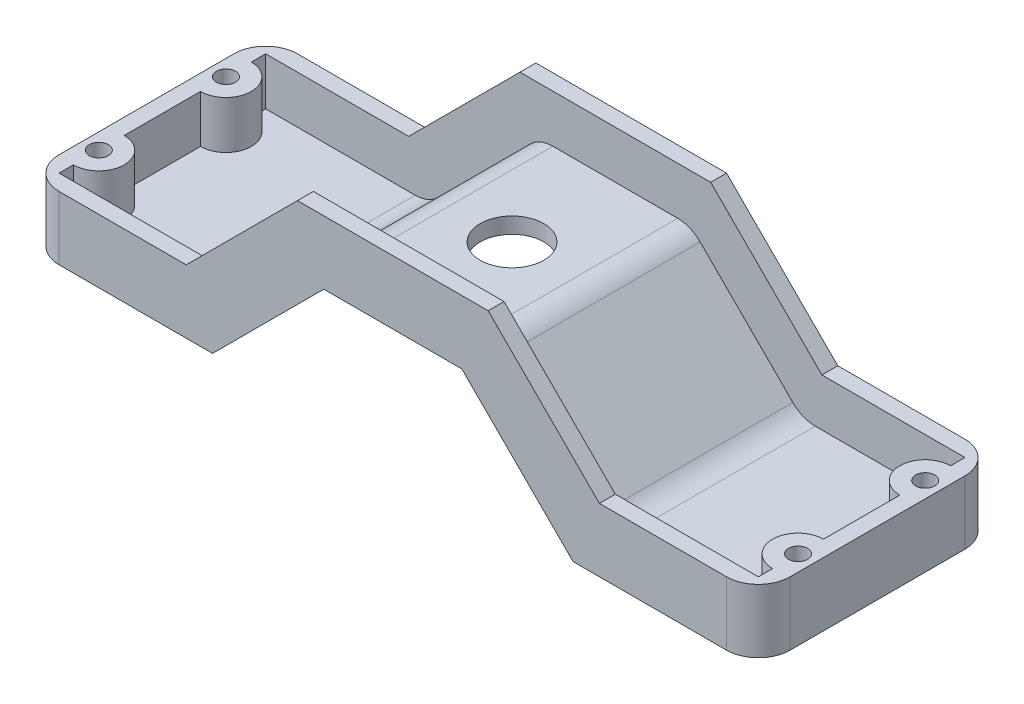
ISO-10303-21;
HEADER;
FILE_DESCRIPTION(('STEP AP214'),'2;1');
FILE_NAME('part.step','',(''),(''),'','','');
FILE_SCHEMA(('AUTOMOTIVE_DESIGN { 1 0 10303 214 1 1 1 1 }'));
ENDSEC;
DATA;
#1=APPLICATION_CONTEXT('core data for automotive mechanical design processes');
#2=APPLICATION_PROTOCOL_DEFINITION('international standard','automotive_design',2000,#1);
#3=PRODUCT_CONTEXT('',#1,'mechanical');
#4=PRODUCT('Part','Part','',(#3));
#5=PRODUCT_RELATED_PRODUCT_CATEGORY('part','',(#4));
#6=PRODUCT_DEFINITION_FORMATION('','',#4);
#7=PRODUCT_DEFINITION_CONTEXT('part definition',#1,'design');
#8=PRODUCT_DEFINITION('design','',#6,#7);
#9=PRODUCT_DEFINITION_SHAPE('','',#8);
#10=(LENGTH_UNIT() NAMED_UNIT(*) SI_UNIT(.MILLI.,.METRE.));
#11=(NAMED_UNIT(*) PLANE_ANGLE_UNIT() SI_UNIT($,.RADIAN.));
#12=(NAMED_UNIT(*) SI_UNIT($,.STERADIAN.) SOLID_ANGLE_UNIT());
#13=UNCERTAINTY_MEASURE_WITH_UNIT(LENGTH_MEASURE(1.E-05),#10,'distance_accuracy_value','');
#14=(GEOMETRIC_REPRESENTATION_CONTEXT(3) GLOBAL_UNCERTAINTY_ASSIGNED_CONTEXT((#13)) GLOBAL_UNIT_ASSIGNED_CONTEXT((#10,
#11,#12)) REPRESENTATION_CONTEXT('',''));
#15=CARTESIAN_POINT('',(0.,0.,0.));
#16=DIRECTION('',(0.,0.,1.));
#17=DIRECTION('',(1.,0.,0.));
#18=AXIS2_PLACEMENT_3D('',#15,#16,#17);
#19=CARTESIAN_POINT('',(180.,0.,37.5));
#20=DIRECTION('',(0.,1.,0.));
#21=DIRECTION('',(-1.,0.,0.));
#22=AXIS2_PLACEMENT_3D('',#19,#20,#21);
#23=PLANE('',#22);
#24=DIRECTION('',(0.,0.,-1.));
#25=VECTOR('',#24,1.);
#26=CARTESIAN_POINT('',(230.,0.,37.5));
#27=LINE('',#26,#25);
#28=CARTESIAN_POINT('',(230.,0.,27.5));
#29=VERTEX_POINT('',#28);
#30=CARTESIAN_POINT('',(230.,0.,-27.5));
#31=VERTEX_POINT('',#30);
#32=EDGE_CURVE('E398',#29,#31,#27,.T.);
#33=ORIENTED_EDGE('',*,*,#32,.T.);
#34=CARTESIAN_POINT('',(220.,0.,-27.5));
#35=DIRECTION('',(0.,1.,0.));
#36=DIRECTION('',(-1.,0.,0.));
#37=AXIS2_PLACEMENT_3D('',#34,#35,#36);
#38=CIRCLE('',#37,10.);
#39=CARTESIAN_POINT('',(220.,0.,-37.5));
#40=VERTEX_POINT('',#39);
#41=EDGE_CURVE('E420',#31,#40,#38,.T.);
#42=ORIENTED_EDGE('',*,*,#41,.T.);
#43=DIRECTION('',(1.,0.,0.));
#44=VECTOR('',#43,1.);
#45=CARTESIAN_POINT('',(180.,0.,-37.5));
#46=LINE('',#45,#44);
#47=CARTESIAN_POINT('',(180.,0.,-37.5));
#48=VERTEX_POINT('',#47);
#49=EDGE_CURVE('E334',#48,#40,#46,.T.);
#50=ORIENTED_EDGE('',*,*,#49,.F.);
#51=DIRECTION('',(0.,0.,-1.));
#52=VECTOR('',#51,1.);
#53=CARTESIAN_POINT('',(180.,0.,37.5));
#54=LINE('',#53,#52);
#55=CARTESIAN_POINT('',(180.,0.,-32.5));
#56=VERTEX_POINT('',#55);
#57=EDGE_CURVE('E394',#56,#48,#54,.T.);
#58=ORIENTED_EDGE('',*,*,#57,.F.);
#59=DIRECTION('',(1.,0.,0.));
#60=VECTOR('',#59,1.);
#61=CARTESIAN_POINT('',(0.,0.,-32.5));
#62=LINE('',#61,#60);
#63=CARTESIAN_POINT('',(225.,0.,-32.5));
#64=VERTEX_POINT('',#63);
#65=EDGE_CURVE('E310',#56,#64,#62,.T.);
#66=ORIENTED_EDGE('',*,*,#65,.T.);
#67=DIRECTION('',(0.,0.,-1.));
#68=VECTOR('',#67,1.);
#69=CARTESIAN_POINT('',(225.,0.,37.5));
#70=LINE('',#69,#68);
#71=CARTESIAN_POINT('',(225.,0.,-28.));
#72=VERTEX_POINT('',#71);
#73=EDGE_CURVE('E302',#72,#64,#70,.T.);
#74=ORIENTED_EDGE('',*,*,#73,.F.);
#75=CARTESIAN_POINT('',(225.,0.,-20.));
#76=DIRECTION('',(0.,-1.,0.));
#77=DIRECTION('',(0.,0.,-1.));
#78=AXIS2_PLACEMENT_3D('',#75,#76,#77);
#79=CIRCLE('',#78,8.);
#80=CARTESIAN_POINT('',(225.,0.,-12.));
#81=VERTEX_POINT('',#80);
#82=EDGE_CURVE('E289',#81,#72,#79,.T.);
#83=ORIENTED_EDGE('',*,*,#82,.F.);
#84=CARTESIAN_POINT('',(225.,0.,12.));
#85=VERTEX_POINT('',#84);
#86=EDGE_CURVE('E311',#85,#81,#70,.T.);
#87=ORIENTED_EDGE('',*,*,#86,.F.);
#88=CARTESIAN_POINT('',(225.,0.,20.));
#89=DIRECTION('',(0.,1.,0.));
#90=DIRECTION('',(0.,0.,1.));
#91=AXIS2_PLACEMENT_3D('',#88,#89,#90);
#92=CIRCLE('',#91,8.);
#93=CARTESIAN_POINT('',(225.,0.,28.));
#94=VERTEX_POINT('',#93);
#95=EDGE_CURVE('E742',#85,#94,#92,.T.);
#96=ORIENTED_EDGE('',*,*,#95,.T.);
#97=CARTESIAN_POINT('',(225.,0.,32.5));
#98=VERTEX_POINT('',#97);
#99=EDGE_CURVE('E58',#98,#94,#70,.T.);
#100=ORIENTED_EDGE('',*,*,#99,.F.);
#101=DIRECTION('',(1.,0.,0.));
#102=VECTOR('',#101,1.);
#103=CARTESIAN_POINT('',(0.,0.,32.5));
#104=LINE('',#103,#102);
#105=CARTESIAN_POINT('',(180.,0.,32.5));
#106=VERTEX_POINT('',#105);
#107=EDGE_CURVE('E530',#106,#98,#104,.T.);
#108=ORIENTED_EDGE('',*,*,#107,.F.);
#109=CARTESIAN_POINT('',(180.,0.,37.5));
#110=VERTEX_POINT('',#109);
#111=EDGE_CURVE('E395',#110,#106,#54,.T.);
#112=ORIENTED_EDGE('',*,*,#111,.F.);
#113=DIRECTION('',(1.,0.,0.));
#114=VECTOR('',#113,1.);
#115=CARTESIAN_POINT('',(180.,0.,37.5));
#116=LINE('',#115,#114);
#117=CARTESIAN_POINT('',(220.,0.,37.5));
#118=VERTEX_POINT('',#117);
#119=EDGE_CURVE('E554',#110,#118,#116,.T.);
#120=ORIENTED_EDGE('',*,*,#119,.T.);
#121=CARTESIAN_POINT('',(220.,0.,27.5));
#122=DIRECTION('',(0.,1.,0.));
#123=DIRECTION('',(-1.,0.,0.));
#124=AXIS2_PLACEMENT_3D('',#121,#122,#123);
#125=CIRCLE('',#124,10.);
#126=EDGE_CURVE('E418',#118,#29,#125,.T.);
#127=ORIENTED_EDGE('',*,*,#126,.T.);
#128=EDGE_LOOP('',(#33,#42,#50,#58,#66,#74,#83,#87,#96,#100,#108,#112,#120,#127));
#129=FACE_BOUND('',#128,.T.);
#130=CARTESIAN_POINT('',(225.,0.,20.));
#131=DIRECTION('',(0.,1.,0.));
#132=DIRECTION('',(0.,0.,-1.));
#133=AXIS2_PLACEMENT_3D('',#130,#131,#132);
#134=CIRCLE('',#133,3.);
#135=CARTESIAN_POINT('',(225.,0.,17.));
#136=VERTEX_POINT('',#135);
#137=EDGE_CURVE('E823',#136,#136,#134,.T.);
#138=ORIENTED_EDGE('',*,*,#137,.F.);
#139=EDGE_LOOP('',(#138));
#140=FACE_BOUND('',#139,.T.);
#141=CARTESIAN_POINT('',(225.,0.,-20.));
#142=DIRECTION('',(0.,-1.,0.));
#143=DIRECTION('',(0.,0.,1.));
#144=AXIS2_PLACEMENT_3D('',#141,#142,#143);
#145=CIRCLE('',#144,3.);
#146=CARTESIAN_POINT('',(225.,0.,-17.));
#147=VERTEX_POINT('',#146);
#148=EDGE_CURVE('E829',#147,#147,#145,.T.);
#149=ORIENTED_EDGE('',*,*,#148,.T.);
#150=EDGE_LOOP('',(#149));
#151=FACE_BOUND('',#150,.T.);
#152=ADVANCED_FACE('F34',(#129,#140,#151),#23,.T.);
#153=CARTESIAN_POINT('',(180.,-20.,37.5));
#154=DIRECTION('',(0.,1.,0.));
#155=DIRECTION('',(-1.,0.,0.));
#156=AXIS2_PLACEMENT_3D('',#153,#154,#155);
#157=PLANE('',#156);
#158=DIRECTION('',(1.,0.,0.));
#159=VECTOR('',#158,1.);
#160=CARTESIAN_POINT('',(180.,-20.,-37.5));
#161=LINE('',#160,#159);
#162=CARTESIAN_POINT('',(171.715728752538,-20.,-37.5));
#163=VERTEX_POINT('',#162);
#164=CARTESIAN_POINT('',(220.,-20.,-37.5));
#165=VERTEX_POINT('',#164);
#166=EDGE_CURVE('E330',#163,#165,#161,.T.);
#167=ORIENTED_EDGE('',*,*,#166,.T.);
#168=CARTESIAN_POINT('',(220.,-20.,-27.5));
#169=DIRECTION('',(0.,1.,0.));
#170=DIRECTION('',(-1.,0.,0.));
#171=AXIS2_PLACEMENT_3D('',#168,#169,#170);
#172=CIRCLE('',#171,10.);
#173=CARTESIAN_POINT('',(230.,-20.,-27.5));
#174=VERTEX_POINT('',#173);
#175=EDGE_CURVE('E411',#165,#174,#172,.F.);
#176=ORIENTED_EDGE('',*,*,#175,.T.);
#177=DIRECTION('',(0.,0.,-1.));
#178=VECTOR('',#177,1.);
#179=CARTESIAN_POINT('',(230.,-20.,37.5));
#180=LINE('',#179,#178);
#181=CARTESIAN_POINT('',(230.,-20.,27.5));
#182=VERTEX_POINT('',#181);
#183=EDGE_CURVE('E400',#182,#174,#180,.T.);
#184=ORIENTED_EDGE('',*,*,#183,.F.);
#185=CARTESIAN_POINT('',(220.,-20.,27.5));
#186=DIRECTION('',(0.,1.,0.));
#187=DIRECTION('',(-1.,0.,0.));
#188=AXIS2_PLACEMENT_3D('',#185,#186,#187);
#189=CIRCLE('',#188,10.);
#190=CARTESIAN_POINT('',(220.,-20.,37.5));
#191=VERTEX_POINT('',#190);
#192=EDGE_CURVE('E409',#182,#191,#189,.F.);
#193=ORIENTED_EDGE('',*,*,#192,.T.);
#194=DIRECTION('',(1.,0.,0.));
#195=VECTOR('',#194,1.);
#196=CARTESIAN_POINT('',(180.,-20.,37.5));
#197=LINE('',#196,#195);
#198=CARTESIAN_POINT('',(171.715728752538,-20.,37.5));
#199=VERTEX_POINT('',#198);
#200=EDGE_CURVE('E364',#199,#191,#197,.T.);
#201=ORIENTED_EDGE('',*,*,#200,.F.);
#202=DIRECTION('',(0.,0.,-1.));
#203=VECTOR('',#202,1.);
#204=CARTESIAN_POINT('',(171.715728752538,-20.,37.5));
#205=LINE('',#204,#203);
#206=EDGE_CURVE('E365',#199,#163,#205,.T.);
#207=ORIENTED_EDGE('',*,*,#206,.T.);
#208=EDGE_LOOP('',(#167,#176,#184,#193,#201,#207));
#209=FACE_BOUND('',#208,.T.);
#210=CARTESIAN_POINT('',(225.,-20.,20.));
#211=DIRECTION('',(0.,1.,0.));
#212=DIRECTION('',(0.,0.,-1.));
#213=AXIS2_PLACEMENT_3D('',#210,#211,#212);
#214=CIRCLE('',#213,3.);
#215=CARTESIAN_POINT('',(225.,-20.,17.));
#216=VERTEX_POINT('',#215);
#217=EDGE_CURVE('E821',#216,#216,#214,.T.);
#218=ORIENTED_EDGE('',*,*,#217,.T.);
#219=EDGE_LOOP('',(#218));
#220=FACE_BOUND('',#219,.T.);
#221=CARTESIAN_POINT('',(225.,-20.,-20.));
#222=DIRECTION('',(0.,-1.,0.));
#223=DIRECTION('',(0.,0.,1.));
#224=AXIS2_PLACEMENT_3D('',#221,#222,#223);
#225=CIRCLE('',#224,3.);
#226=CARTESIAN_POINT('',(225.,-20.,-17.));
#227=VERTEX_POINT('',#226);
#228=EDGE_CURVE('E296',#227,#227,#225,.T.);
#229=ORIENTED_EDGE('',*,*,#228,.F.);
#230=EDGE_LOOP('',(#229));
#231=FACE_BOUND('',#230,.T.);
#232=ADVANCED_FACE('F583',(#209,#220,#231),#157,.F.);
#233=CARTESIAN_POINT('',(225.,0.,37.5));
#234=DIRECTION('',(1.,0.,0.));
#235=DIRECTION('',(0.,0.,-1.));
#236=AXIS2_PLACEMENT_3D('',#233,#234,#235);
#237=PLANE('',#236);
#238=DIRECTION('',(0.,1.,0.));
#239=VECTOR('',#238,1.);
#240=CARTESIAN_POINT('',(225.,-500000.,-28.));
#241=LINE('',#240,#239);
#242=CARTESIAN_POINT('',(225.,-15.,-28.));
#243=VERTEX_POINT('',#242);
#244=EDGE_CURVE('E50',#243,#72,#241,.T.);
#245=ORIENTED_EDGE('',*,*,#244,.T.);
#246=ORIENTED_EDGE('',*,*,#73,.T.);
#247=DIRECTION('',(0.,-1.,0.));
#248=VECTOR('',#247,1.);
#249=CARTESIAN_POINT('',(225.,0.,-32.5));
#250=LINE('',#249,#248);
#251=CARTESIAN_POINT('',(225.,-15.,-32.5));
#252=VERTEX_POINT('',#251);
#253=EDGE_CURVE('E533',#64,#252,#250,.T.);
#254=ORIENTED_EDGE('',*,*,#253,.T.);
#255=DIRECTION('',(0.,0.,-1.));
#256=VECTOR('',#255,1.);
#257=CARTESIAN_POINT('',(225.,-15.,37.5));
#258=LINE('',#257,#256);
#259=EDGE_CURVE('E304',#243,#252,#258,.T.);
#260=ORIENTED_EDGE('',*,*,#259,.F.);
#261=EDGE_LOOP('',(#245,#246,#254,#260));
#262=FACE_BOUND('',#261,.T.);
#263=ADVANCED_FACE('F300',(#262),#237,.F.);
#264=DIRECTION('',(0.,1.,0.));
#265=VECTOR('',#264,1.);
#266=CARTESIAN_POINT('',(225.,-500000.,-12.));
#267=LINE('',#266,#265);
#268=CARTESIAN_POINT('',(225.,-15.0000000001,-12.));
#269=VERTEX_POINT('',#268);
#270=EDGE_CURVE('E292',#269,#81,#267,.T.);
#271=ORIENTED_EDGE('',*,*,#270,.F.);
#272=CARTESIAN_POINT('',(225.,-15.,12.));
#273=VERTEX_POINT('',#272);
#274=EDGE_CURVE('E320',#273,#269,#258,.T.);
#275=ORIENTED_EDGE('',*,*,#274,.F.);
#276=DIRECTION('',(0.,1.,0.));
#277=VECTOR('',#276,1.);
#278=CARTESIAN_POINT('',(225.,-500000.,12.));
#279=LINE('',#278,#277);
#280=EDGE_CURVE('E737',#273,#85,#279,.T.);
#281=ORIENTED_EDGE('',*,*,#280,.T.);
#282=ORIENTED_EDGE('',*,*,#86,.T.);
#283=EDGE_LOOP('',(#271,#275,#281,#282));
#284=FACE_BOUND('',#283,.T.);
#285=ADVANCED_FACE('F802',(#284),#237,.F.);
#286=CARTESIAN_POINT('',(180.,-15.,37.5));
#287=DIRECTION('',(0.,1.,0.));
#288=DIRECTION('',(-1.,0.,0.));
#289=AXIS2_PLACEMENT_3D('',#286,#287,#288);
#290=PLANE('',#289);
#291=ORIENTED_EDGE('',*,*,#274,.T.);
#292=CARTESIAN_POINT('',(225.,-14.9999999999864,-20.));
#293=DIRECTION('',(0.,1.,0.));
#294=DIRECTION('',(-1.,0.,0.));
#295=AXIS2_PLACEMENT_3D('',#292,#293,#294);
#296=CIRCLE('',#295,8.);
#297=EDGE_CURVE('E818',#243,#269,#296,.T.);
#298=ORIENTED_EDGE('',*,*,#297,.F.);
#299=ORIENTED_EDGE('',*,*,#259,.T.);
#300=DIRECTION('',(1.,0.,0.));
#301=VECTOR('',#300,1.);
#302=CARTESIAN_POINT('',(0.,-15.,-32.5));
#303=LINE('',#302,#301);
#304=CARTESIAN_POINT('',(177.928932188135,-15.,-32.5));
#305=VERTEX_POINT('',#304);
#306=EDGE_CURVE('E534',#305,#252,#303,.T.);
#307=ORIENTED_EDGE('',*,*,#306,.F.);
#308=DIRECTION('',(0.,0.,-1.));
#309=VECTOR('',#308,1.);
#310=CARTESIAN_POINT('',(177.928932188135,-15.,32.5));
#311=LINE('',#310,#309);
#312=CARTESIAN_POINT('',(177.928932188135,-15.,32.5));
#313=VERTEX_POINT('',#312);
#314=EDGE_CURVE('E448',#305,#313,#311,.F.);
#315=ORIENTED_EDGE('',*,*,#314,.T.);
#316=DIRECTION('',(1.,0.,0.));
#317=VECTOR('',#316,1.);
#318=CARTESIAN_POINT('',(0.,-15.,32.5));
#319=LINE('',#318,#317);
#320=CARTESIAN_POINT('',(225.,-15.,32.5));
#321=VERTEX_POINT('',#320);
#322=EDGE_CURVE('E526',#313,#321,#319,.T.);
#323=ORIENTED_EDGE('',*,*,#322,.T.);
#324=CARTESIAN_POINT('',(225.,-15.,28.));
#325=VERTEX_POINT('',#324);
#326=EDGE_CURVE('E322',#321,#325,#258,.T.);
#327=ORIENTED_EDGE('',*,*,#326,.T.);
#328=CARTESIAN_POINT('',(225.,-14.9999999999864,20.));
#329=DIRECTION('',(0.,1.,0.));
#330=DIRECTION('',(-1.,0.,0.));
#331=AXIS2_PLACEMENT_3D('',#328,#329,#330);
#332=CIRCLE('',#331,8.);
#333=EDGE_CURVE('E736',#325,#273,#332,.F.);
#334=ORIENTED_EDGE('',*,*,#333,.T.);
#335=EDGE_LOOP('',(#291,#298,#299,#307,#315,#323,#327,#334));
#336=FACE_BOUND('',#335,.T.);
#337=ADVANCED_FACE('F774',(#336),#290,.T.);
#338=CARTESIAN_POINT('',(0.,0.,37.5));
#339=DIRECTION('',(0.,1.,0.));
#340=DIRECTION('',(0.,0.,1.));
#341=AXIS2_PLACEMENT_3D('',#338,#339,#340);
#342=PLANE('',#341);
#343=DIRECTION('',(1.,0.,0.));
#344=VECTOR('',#343,1.);
#345=CARTESIAN_POINT('',(0.,0.,-37.5));
#346=LINE('',#345,#344);
#347=CARTESIAN_POINT('',(10.,0.,-37.5));
#348=VERTEX_POINT('',#347);
#349=CARTESIAN_POINT('',(50.,0.,-37.5));
#350=VERTEX_POINT('',#349);
#351=EDGE_CURVE('E354',#348,#350,#346,.T.);
#352=ORIENTED_EDGE('',*,*,#351,.F.);
#353=CARTESIAN_POINT('',(10.,0.,-27.5));
#354=DIRECTION('',(0.,1.,0.));
#355=DIRECTION('',(0.,0.,1.));
#356=AXIS2_PLACEMENT_3D('',#353,#354,#355);
#357=CIRCLE('',#356,10.);
#358=CARTESIAN_POINT('',(0.,0.,-27.5));
#359=VERTEX_POINT('',#358);
#360=EDGE_CURVE('E424',#348,#359,#357,.T.);
#361=ORIENTED_EDGE('',*,*,#360,.T.);
#362=DIRECTION('',(0.,0.,-1.));
#363=VECTOR('',#362,1.);
#364=CARTESIAN_POINT('',(0.,0.,37.5));
#365=LINE('',#364,#363);
#366=CARTESIAN_POINT('',(0.,0.,27.5));
#367=VERTEX_POINT('',#366);
#368=EDGE_CURVE('E379',#367,#359,#365,.T.);
#369=ORIENTED_EDGE('',*,*,#368,.F.);
#370=CARTESIAN_POINT('',(10.,0.,27.5));
#371=DIRECTION('',(0.,1.,0.));
#372=DIRECTION('',(0.,0.,1.));
#373=AXIS2_PLACEMENT_3D('',#370,#371,#372);
#374=CIRCLE('',#373,10.);
#375=CARTESIAN_POINT('',(10.,0.,37.5));
#376=VERTEX_POINT('',#375);
#377=EDGE_CURVE('E422',#367,#376,#374,.T.);
#378=ORIENTED_EDGE('',*,*,#377,.T.);
#379=DIRECTION('',(1.,0.,0.));
#380=VECTOR('',#379,1.);
#381=CARTESIAN_POINT('',(0.,0.,37.5));
#382=LINE('',#381,#380);
#383=CARTESIAN_POINT('',(50.,0.,37.5));
#384=VERTEX_POINT('',#383);
#385=EDGE_CURVE('E566',#376,#384,#382,.T.);
#386=ORIENTED_EDGE('',*,*,#385,.T.);
#387=DIRECTION('',(0.,0.,-1.));
#388=VECTOR('',#387,1.);
#389=CARTESIAN_POINT('',(50.,0.,37.5));
#390=LINE('',#389,#388);
#391=CARTESIAN_POINT('',(50.,0.,32.5));
#392=VERTEX_POINT('',#391);
#393=EDGE_CURVE('E383',#384,#392,#390,.T.);
#394=ORIENTED_EDGE('',*,*,#393,.T.);
#395=DIRECTION('',(1.,0.,0.));
#396=VECTOR('',#395,1.);
#397=CARTESIAN_POINT('',(0.,0.,32.5));
#398=LINE('',#397,#396);
#399=CARTESIAN_POINT('',(5.,0.,32.5));
#400=VERTEX_POINT('',#399);
#401=EDGE_CURVE('E535',#400,#392,#398,.T.);
#402=ORIENTED_EDGE('',*,*,#401,.F.);
#403=DIRECTION('',(0.,0.,-1.));
#404=VECTOR('',#403,1.);
#405=CARTESIAN_POINT('',(5.,0.,37.5));
#406=LINE('',#405,#404);
#407=CARTESIAN_POINT('',(5.,0.,28.));
#408=VERTEX_POINT('',#407);
#409=EDGE_CURVE('E312',#400,#408,#406,.T.);
#410=ORIENTED_EDGE('',*,*,#409,.T.);
#411=CARTESIAN_POINT('',(5.,0.,20.));
#412=DIRECTION('',(0.,-1.,0.));
#413=DIRECTION('',(0.,0.,1.));
#414=AXIS2_PLACEMENT_3D('',#411,#412,#413);
#415=CIRCLE('',#414,8.);
#416=CARTESIAN_POINT('',(5.,0.,12.));
#417=VERTEX_POINT('',#416);
#418=EDGE_CURVE('E749',#417,#408,#415,.T.);
#419=ORIENTED_EDGE('',*,*,#418,.F.);
#420=CARTESIAN_POINT('',(5.,0.,-12.));
#421=VERTEX_POINT('',#420);
#422=EDGE_CURVE('E315',#417,#421,#406,.T.);
#423=ORIENTED_EDGE('',*,*,#422,.T.);
#424=CARTESIAN_POINT('',(5.,0.,-20.));
#425=DIRECTION('',(0.,1.,0.));
#426=DIRECTION('',(0.,0.,-1.));
#427=AXIS2_PLACEMENT_3D('',#424,#425,#426);
#428=CIRCLE('',#427,8.);
#429=CARTESIAN_POINT('',(5.,0.,-28.));
#430=VERTEX_POINT('',#429);
#431=EDGE_CURVE('E764',#421,#430,#428,.T.);
#432=ORIENTED_EDGE('',*,*,#431,.T.);
#433=CARTESIAN_POINT('',(5.,0.,-32.5));
#434=VERTEX_POINT('',#433);
#435=EDGE_CURVE('E317',#430,#434,#406,.T.);
#436=ORIENTED_EDGE('',*,*,#435,.T.);
#437=DIRECTION('',(1.,0.,0.));
#438=VECTOR('',#437,1.);
#439=CARTESIAN_POINT('',(0.,0.,-32.5));
#440=LINE('',#439,#438);
#441=CARTESIAN_POINT('',(50.,0.,-32.5));
#442=VERTEX_POINT('',#441);
#443=EDGE_CURVE('E519',#434,#442,#440,.T.);
#444=ORIENTED_EDGE('',*,*,#443,.T.);
#445=EDGE_CURVE('E382',#442,#350,#390,.T.);
#446=ORIENTED_EDGE('',*,*,#445,.T.);
#447=EDGE_LOOP('',(#352,#361,#369,#378,#386,#394,#402,#410,#419,#423,#432,#436,#444,#446));
#448=FACE_BOUND('',#447,.T.);
#449=CARTESIAN_POINT('',(5.,0.,-20.));
#450=DIRECTION('',(0.,1.,0.));
#451=DIRECTION('',(0.,0.,1.));
#452=AXIS2_PLACEMENT_3D('',#449,#450,#451);
#453=CIRCLE('',#452,3.);
#454=CARTESIAN_POINT('',(5.,0.,-17.));
#455=VERTEX_POINT('',#454);
#456=EDGE_CURVE('E757',#455,#455,#453,.T.);
#457=ORIENTED_EDGE('',*,*,#456,.F.);
#458=EDGE_LOOP('',(#457));
#459=FACE_BOUND('',#458,.T.);
#460=CARTESIAN_POINT('',(5.,0.,20.));
#461=DIRECTION('',(0.,-1.,0.));
#462=DIRECTION('',(0.,0.,-1.));
#463=AXIS2_PLACEMENT_3D('',#460,#461,#462);
#464=CIRCLE('',#463,3.);
#465=CARTESIAN_POINT('',(5.,0.,17.));
#466=VERTEX_POINT('',#465);
#467=EDGE_CURVE('E739',#466,#466,#464,.T.);
#468=ORIENTED_EDGE('',*,*,#467,.T.);
#469=EDGE_LOOP('',(#468));
#470=FACE_BOUND('',#469,.T.);
#471=ADVANCED_FACE('F620',(#448,#459,#470),#342,.T.);
#472=CARTESIAN_POINT('',(0.,-20.,37.5));
#473=DIRECTION('',(0.,1.,0.));
#474=DIRECTION('',(0.,0.,1.));
#475=AXIS2_PLACEMENT_3D('',#472,#473,#474);
#476=PLANE('',#475);
#477=DIRECTION('',(0.,0.,-1.));
#478=VECTOR('',#477,1.);
#479=CARTESIAN_POINT('',(0.,-20.,37.5));
#480=LINE('',#479,#478);
#481=CARTESIAN_POINT('',(0.,-20.,27.5));
#482=VERTEX_POINT('',#481);
#483=CARTESIAN_POINT('',(0.,-20.,-27.5));
#484=VERTEX_POINT('',#483);
#485=EDGE_CURVE('E376',#482,#484,#480,.T.);
#486=ORIENTED_EDGE('',*,*,#485,.T.);
#487=CARTESIAN_POINT('',(10.,-20.,-27.5));
#488=DIRECTION('',(0.,1.,0.));
#489=DIRECTION('',(0.,0.,1.));
#490=AXIS2_PLACEMENT_3D('',#487,#488,#489);
#491=CIRCLE('',#490,10.);
#492=CARTESIAN_POINT('',(10.,-20.,-37.5));
#493=VERTEX_POINT('',#492);
#494=EDGE_CURVE('E433',#484,#493,#491,.F.);
#495=ORIENTED_EDGE('',*,*,#494,.T.);
#496=DIRECTION('',(1.,0.,0.));
#497=VECTOR('',#496,1.);
#498=CARTESIAN_POINT('',(0.,-20.,-37.5));
#499=LINE('',#498,#497);
#500=CARTESIAN_POINT('',(58.2842712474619,-20.,-37.5));
#501=VERTEX_POINT('',#500);
#502=EDGE_CURVE('E356',#493,#501,#499,.T.);
#503=ORIENTED_EDGE('',*,*,#502,.T.);
#504=DIRECTION('',(0.,0.,-1.));
#505=VECTOR('',#504,1.);
#506=CARTESIAN_POINT('',(58.2842712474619,-20.,37.5));
#507=LINE('',#506,#505);
#508=CARTESIAN_POINT('',(58.2842712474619,-20.,37.5));
#509=VERTEX_POINT('',#508);
#510=EDGE_CURVE('E373',#509,#501,#507,.T.);
#511=ORIENTED_EDGE('',*,*,#510,.F.);
#512=DIRECTION('',(1.,0.,0.));
#513=VECTOR('',#512,1.);
#514=CARTESIAN_POINT('',(0.,-20.,37.5));
#515=LINE('',#514,#513);
#516=CARTESIAN_POINT('',(10.,-20.,37.5));
#517=VERTEX_POINT('',#516);
#518=EDGE_CURVE('E568',#517,#509,#515,.T.);
#519=ORIENTED_EDGE('',*,*,#518,.F.);
#520=CARTESIAN_POINT('',(10.,-20.,27.5));
#521=DIRECTION('',(0.,1.,0.));
#522=DIRECTION('',(0.,0.,1.));
#523=AXIS2_PLACEMENT_3D('',#520,#521,#522);
#524=CIRCLE('',#523,10.);
#525=EDGE_CURVE('E431',#517,#482,#524,.F.);
#526=ORIENTED_EDGE('',*,*,#525,.T.);
#527=EDGE_LOOP('',(#486,#495,#503,#511,#519,#526));
#528=FACE_BOUND('',#527,.T.);
#529=CARTESIAN_POINT('',(5.,-20.,-20.));
#530=DIRECTION('',(0.,1.,0.));
#531=DIRECTION('',(0.,0.,1.));
#532=AXIS2_PLACEMENT_3D('',#529,#530,#531);
#533=CIRCLE('',#532,3.);
#534=CARTESIAN_POINT('',(5.,-20.,-17.));
#535=VERTEX_POINT('',#534);
#536=EDGE_CURVE('E758',#535,#535,#533,.T.);
#537=ORIENTED_EDGE('',*,*,#536,.T.);
#538=EDGE_LOOP('',(#537));
#539=FACE_BOUND('',#538,.T.);
#540=CARTESIAN_POINT('',(5.,-20.,20.));
#541=DIRECTION('',(0.,-1.,0.));
#542=DIRECTION('',(0.,0.,-1.));
#543=AXIS2_PLACEMENT_3D('',#540,#541,#542);
#544=CIRCLE('',#543,3.);
#545=CARTESIAN_POINT('',(5.,-20.,17.));
#546=VERTEX_POINT('',#545);
#547=EDGE_CURVE('E746',#546,#546,#544,.T.);
#548=ORIENTED_EDGE('',*,*,#547,.F.);
#549=EDGE_LOOP('',(#548));
#550=FACE_BOUND('',#549,.T.);
#551=ADVANCED_FACE('F641',(#528,#539,#550),#476,.F.);
#552=CARTESIAN_POINT('',(5.,-20.,37.5));
#553=DIRECTION('',(-1.,0.,0.));
#554=DIRECTION('',(0.,0.,1.));
#555=AXIS2_PLACEMENT_3D('',#552,#553,#554);
#556=PLANE('',#555);
#557=DIRECTION('',(0.,1.,0.));
#558=VECTOR('',#557,1.);
#559=CARTESIAN_POINT('',(5.,-500000.,28.));
#560=LINE('',#559,#558);
#561=CARTESIAN_POINT('',(5.,-15.,28.));
#562=VERTEX_POINT('',#561);
#563=EDGE_CURVE('E713',#562,#408,#560,.T.);
#564=ORIENTED_EDGE('',*,*,#563,.T.);
#565=ORIENTED_EDGE('',*,*,#409,.F.);
#566=DIRECTION('',(0.,1.,0.));
#567=VECTOR('',#566,1.);
#568=CARTESIAN_POINT('',(5.,0.,32.5));
#569=LINE('',#568,#567);
#570=CARTESIAN_POINT('',(5.,-15.,32.5));
#571=VERTEX_POINT('',#570);
#572=EDGE_CURVE('E508',#571,#400,#569,.T.);
#573=ORIENTED_EDGE('',*,*,#572,.F.);
#574=DIRECTION('',(0.,0.,-1.));
#575=VECTOR('',#574,1.);
#576=CARTESIAN_POINT('',(5.,-15.,37.5));
#577=LINE('',#576,#575);
#578=EDGE_CURVE('E520',#571,#562,#577,.T.);
#579=ORIENTED_EDGE('',*,*,#578,.T.);
#580=EDGE_LOOP('',(#564,#565,#573,#579));
#581=FACE_BOUND('',#580,.T.);
#582=ADVANCED_FACE('F712',(#581),#556,.F.);
#583=DIRECTION('',(0.,1.,0.));
#584=VECTOR('',#583,1.);
#585=CARTESIAN_POINT('',(5.,-500000.,12.));
#586=LINE('',#585,#584);
#587=CARTESIAN_POINT('',(5.,-15.0000000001,12.));
#588=VERTEX_POINT('',#587);
#589=EDGE_CURVE('E753',#588,#417,#586,.T.);
#590=ORIENTED_EDGE('',*,*,#589,.F.);
#591=CARTESIAN_POINT('',(5.,-14.9999999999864,-12.));
#592=VERTEX_POINT('',#591);
#593=EDGE_CURVE('E523',#588,#592,#577,.T.);
#594=ORIENTED_EDGE('',*,*,#593,.T.);
#595=DIRECTION('',(0.,1.,0.));
#596=VECTOR('',#595,1.);
#597=CARTESIAN_POINT('',(5.,-500000.,-12.));
#598=LINE('',#597,#596);
#599=EDGE_CURVE('E766',#592,#421,#598,.T.);
#600=ORIENTED_EDGE('',*,*,#599,.T.);
#601=ORIENTED_EDGE('',*,*,#422,.F.);
#602=EDGE_LOOP('',(#590,#594,#600,#601));
#603=FACE_BOUND('',#602,.T.);
#604=ADVANCED_FACE('F808',(#603),#556,.F.);
#605=CARTESIAN_POINT('',(0.,-15.,37.5));
#606=DIRECTION('',(0.,1.,0.));
#607=DIRECTION('',(0.,0.,1.));
#608=AXIS2_PLACEMENT_3D('',#605,#606,#607);
#609=PLANE('',#608);
#610=ORIENTED_EDGE('',*,*,#593,.F.);
#611=CARTESIAN_POINT('',(5.,-14.9999999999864,20.));
#612=DIRECTION('',(0.,1.,0.));
#613=DIRECTION('',(0.,0.,1.));
#614=AXIS2_PLACEMENT_3D('',#611,#612,#613);
#615=CIRCLE('',#614,8.);
#616=EDGE_CURVE('E709',#562,#588,#615,.T.);
#617=ORIENTED_EDGE('',*,*,#616,.F.);
#618=ORIENTED_EDGE('',*,*,#578,.F.);
#619=DIRECTION('',(1.,0.,0.));
#620=VECTOR('',#619,1.);
#621=CARTESIAN_POINT('',(0.,-15.,32.5));
#622=LINE('',#621,#620);
#623=CARTESIAN_POINT('',(52.0710678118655,-15.,32.5));
#624=VERTEX_POINT('',#623);
#625=EDGE_CURVE('E503',#571,#624,#622,.T.);
#626=ORIENTED_EDGE('',*,*,#625,.T.);
#627=DIRECTION('',(0.,0.,-1.));
#628=VECTOR('',#627,1.);
#629=CARTESIAN_POINT('',(52.0710678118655,-15.,-32.5));
#630=LINE('',#629,#628);
#631=CARTESIAN_POINT('',(52.0710678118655,-15.,-32.5));
#632=VERTEX_POINT('',#631);
#633=EDGE_CURVE('E464',#624,#632,#630,.T.);
#634=ORIENTED_EDGE('',*,*,#633,.T.);
#635=DIRECTION('',(1.,0.,0.));
#636=VECTOR('',#635,1.);
#637=CARTESIAN_POINT('',(0.,-15.,-32.5));
#638=LINE('',#637,#636);
#639=CARTESIAN_POINT('',(5.,-15.,-32.5));
#640=VERTEX_POINT('',#639);
#641=EDGE_CURVE('E518',#640,#632,#638,.T.);
#642=ORIENTED_EDGE('',*,*,#641,.F.);
#643=CARTESIAN_POINT('',(5.,-15.0000000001,-28.));
#644=VERTEX_POINT('',#643);
#645=EDGE_CURVE('E514',#644,#640,#577,.T.);
#646=ORIENTED_EDGE('',*,*,#645,.F.);
#647=CARTESIAN_POINT('',(5.,-14.9999999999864,-20.));
#648=DIRECTION('',(0.,1.,0.));
#649=DIRECTION('',(0.,0.,1.));
#650=AXIS2_PLACEMENT_3D('',#647,#648,#649);
#651=CIRCLE('',#650,8.);
#652=EDGE_CURVE('E761',#644,#592,#651,.F.);
#653=ORIENTED_EDGE('',*,*,#652,.T.);
#654=EDGE_LOOP('',(#610,#617,#618,#626,#634,#642,#646,#653));
#655=FACE_BOUND('',#654,.T.);
#656=ADVANCED_FACE('F706',(#655),#609,.T.);
#657=CARTESIAN_POINT('',(145.,35.,37.5));
#658=DIRECTION('',(0.707106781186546,0.707106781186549,0.));
#659=DIRECTION('',(-0.707106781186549,0.707106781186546,0.));
#660=AXIS2_PLACEMENT_3D('',#657,#658,#659);
#661=PLANE('',#660);
#662=DIRECTION('',(0.,0.,-1.));
#663=VECTOR('',#662,1.);
#664=CARTESIAN_POINT('',(145.,35.,37.5));
#665=LINE('',#664,#663);
#666=CARTESIAN_POINT('',(145.,35.,-32.5));
#667=VERTEX_POINT('',#666);
#668=CARTESIAN_POINT('',(145.,35.,-37.5));
#669=VERTEX_POINT('',#668);
#670=EDGE_CURVE('E390',#667,#669,#665,.T.);
#671=ORIENTED_EDGE('',*,*,#670,.F.);
#672=DIRECTION('',(0.707106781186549,-0.707106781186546,0.));
#673=VECTOR('',#672,1.);
#674=CARTESIAN_POINT('',(89.9999999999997,90.,-32.5));
#675=LINE('',#674,#673);
#676=EDGE_CURVE('E606',#667,#56,#675,.T.);
#677=ORIENTED_EDGE('',*,*,#676,.T.);
#678=ORIENTED_EDGE('',*,*,#57,.T.);
#679=DIRECTION('',(0.707106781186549,-0.707106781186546,0.));
#680=VECTOR('',#679,1.);
#681=CARTESIAN_POINT('',(145.,35.,-37.5));
#682=LINE('',#681,#680);
#683=EDGE_CURVE('E340',#669,#48,#682,.T.);
#684=ORIENTED_EDGE('',*,*,#683,.F.);
#685=EDGE_LOOP('',(#671,#677,#678,#684));
#686=FACE_BOUND('',#685,.T.);
#687=ADVANCED_FACE('F605',(#686),#661,.T.);
#688=CARTESIAN_POINT('',(84.9999999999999,35.,37.5));
#689=DIRECTION('',(0.,1.,0.));
#690=DIRECTION('',(0.,0.,1.));
#691=AXIS2_PLACEMENT_3D('',#688,#689,#690);
#692=PLANE('',#691);
#693=DIRECTION('',(0.,0.,-1.));
#694=VECTOR('',#693,1.);
#695=CARTESIAN_POINT('',(84.9999999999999,35.,37.5));
#696=LINE('',#695,#694);
#697=CARTESIAN_POINT('',(84.9999999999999,35.,-32.5));
#698=VERTEX_POINT('',#697);
#699=CARTESIAN_POINT('',(84.9999999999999,35.,-37.5));
#700=VERTEX_POINT('',#699);
#701=EDGE_CURVE('E386',#698,#700,#696,.T.);
#702=ORIENTED_EDGE('',*,*,#701,.F.);
#703=DIRECTION('',(1.,0.,0.));
#704=VECTOR('',#703,1.);
#705=CARTESIAN_POINT('',(0.,35.,-32.5));
#706=LINE('',#705,#704);
#707=EDGE_CURVE('E608',#698,#667,#706,.T.);
#708=ORIENTED_EDGE('',*,*,#707,.T.);
#709=ORIENTED_EDGE('',*,*,#670,.T.);
#710=DIRECTION('',(1.,0.,0.));
#711=VECTOR('',#710,1.);
#712=CARTESIAN_POINT('',(84.9999999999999,35.,-37.5));
#713=LINE('',#712,#711);
#714=EDGE_CURVE('E348',#700,#669,#713,.T.);
#715=ORIENTED_EDGE('',*,*,#714,.F.);
#716=EDGE_LOOP('',(#702,#708,#709,#715));
#717=FACE_BOUND('',#716,.T.);
#718=ADVANCED_FACE('F886',(#717),#692,.T.);
#719=CARTESIAN_POINT('',(50.,0.,37.5));
#720=DIRECTION('',(-0.707106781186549,0.707106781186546,0.));
#721=DIRECTION('',(-0.707106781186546,-0.707106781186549,0.));
#722=AXIS2_PLACEMENT_3D('',#719,#720,#721);
#723=PLANE('',#722);
#724=ORIENTED_EDGE('',*,*,#445,.F.);
#725=DIRECTION('',(0.707106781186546,0.707106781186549,0.));
#726=VECTOR('',#725,1.);
#727=CARTESIAN_POINT('',(25.0000000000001,-25.,-32.5));
#728=LINE('',#727,#726);
#729=EDGE_CURVE('E610',#442,#698,#728,.T.);
#730=ORIENTED_EDGE('',*,*,#729,.T.);
#731=ORIENTED_EDGE('',*,*,#701,.T.);
#732=DIRECTION('',(0.707106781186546,0.707106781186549,0.));
#733=VECTOR('',#732,1.);
#734=CARTESIAN_POINT('',(50.,0.,-37.5));
#735=LINE('',#734,#733);
#736=EDGE_CURVE('E351',#350,#700,#735,.T.);
#737=ORIENTED_EDGE('',*,*,#736,.F.);
#738=EDGE_LOOP('',(#724,#730,#731,#737));
#739=FACE_BOUND('',#738,.T.);
#740=ADVANCED_FACE('F626',(#739),#723,.T.);
#741=CARTESIAN_POINT('',(230.,0.,37.5));
#742=DIRECTION('',(1.,0.,0.));
#743=DIRECTION('',(0.,0.,-1.));
#744=AXIS2_PLACEMENT_3D('',#741,#742,#743);
#745=PLANE('',#744);
#746=ORIENTED_EDGE('',*,*,#183,.T.);
#747=DIRECTION('',(0.,-1.,0.));
#748=VECTOR('',#747,1.);
#749=CARTESIAN_POINT('',(230.,0.,-27.5));
#750=LINE('',#749,#748);
#751=EDGE_CURVE('E416',#174,#31,#750,.F.);
#752=ORIENTED_EDGE('',*,*,#751,.T.);
#753=ORIENTED_EDGE('',*,*,#32,.F.);
#754=DIRECTION('',(0.,-1.,0.));
#755=VECTOR('',#754,1.);
#756=CARTESIAN_POINT('',(230.,-20.,27.5));
#757=LINE('',#756,#755);
#758=EDGE_CURVE('E413',#29,#182,#757,.T.);
#759=ORIENTED_EDGE('',*,*,#758,.T.);
#760=EDGE_LOOP('',(#746,#752,#753,#759));
#761=FACE_BOUND('',#760,.T.);
#762=ADVANCED_FACE('F592',(#761),#745,.T.);
#763=DIRECTION('',(0.707106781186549,-0.707106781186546,0.));
#764=VECTOR('',#763,1.);
#765=CARTESIAN_POINT('',(89.9999999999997,90.,32.5));
#766=LINE('',#765,#764);
#767=CARTESIAN_POINT('',(145.,35.,32.5));
#768=VERTEX_POINT('',#767);
#769=EDGE_CURVE('E548',#768,#106,#766,.T.);
#770=ORIENTED_EDGE('',*,*,#769,.F.);
#771=CARTESIAN_POINT('',(145.,35.,37.5));
#772=VERTEX_POINT('',#771);
#773=EDGE_CURVE('E391',#772,#768,#665,.T.);
#774=ORIENTED_EDGE('',*,*,#773,.F.);
#775=DIRECTION('',(0.707106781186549,-0.707106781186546,0.));
#776=VECTOR('',#775,1.);
#777=CARTESIAN_POINT('',(145.,35.,37.5));
#778=LINE('',#777,#776);
#779=EDGE_CURVE('E557',#772,#110,#778,.T.);
#780=ORIENTED_EDGE('',*,*,#779,.T.);
#781=ORIENTED_EDGE('',*,*,#111,.T.);
#782=EDGE_LOOP('',(#770,#774,#780,#781));
#783=FACE_BOUND('',#782,.T.);
#784=ADVANCED_FACE('F670',(#783),#661,.T.);
#785=DIRECTION('',(1.,0.,0.));
#786=VECTOR('',#785,1.);
#787=CARTESIAN_POINT('',(0.,35.,32.5));
#788=LINE('',#787,#786);
#789=CARTESIAN_POINT('',(84.9999999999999,35.,32.5));
#790=VERTEX_POINT('',#789);
#791=EDGE_CURVE('E543',#790,#768,#788,.T.);
#792=ORIENTED_EDGE('',*,*,#791,.F.);
#793=CARTESIAN_POINT('',(84.9999999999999,35.,37.5));
#794=VERTEX_POINT('',#793);
#795=EDGE_CURVE('E387',#794,#790,#696,.T.);
#796=ORIENTED_EDGE('',*,*,#795,.F.);
#797=DIRECTION('',(1.,0.,0.));
#798=VECTOR('',#797,1.);
#799=CARTESIAN_POINT('',(84.9999999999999,35.,37.5));
#800=LINE('',#799,#798);
#801=EDGE_CURVE('E560',#794,#772,#800,.T.);
#802=ORIENTED_EDGE('',*,*,#801,.T.);
#803=ORIENTED_EDGE('',*,*,#773,.T.);
#804=EDGE_LOOP('',(#792,#796,#802,#803));
#805=FACE_BOUND('',#804,.T.);
#806=ADVANCED_FACE('F726',(#805),#692,.T.);
#807=DIRECTION('',(0.707106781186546,0.707106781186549,0.));
#808=VECTOR('',#807,1.);
#809=CARTESIAN_POINT('',(25.0000000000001,-25.,32.5));
#810=LINE('',#809,#808);
#811=EDGE_CURVE('E539',#392,#790,#810,.T.);
#812=ORIENTED_EDGE('',*,*,#811,.F.);
#813=ORIENTED_EDGE('',*,*,#393,.F.);
#814=DIRECTION('',(0.707106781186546,0.707106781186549,0.));
#815=VECTOR('',#814,1.);
#816=CARTESIAN_POINT('',(50.,0.,37.5));
#817=LINE('',#816,#815);
#818=EDGE_CURVE('E563',#384,#794,#817,.T.);
#819=ORIENTED_EDGE('',*,*,#818,.T.);
#820=ORIENTED_EDGE('',*,*,#795,.T.);
#821=EDGE_LOOP('',(#812,#813,#819,#820));
#822=FACE_BOUND('',#821,.T.);
#823=ADVANCED_FACE('F719',(#822),#723,.T.);
#824=CARTESIAN_POINT('',(0.,-20.,37.5));
#825=DIRECTION('',(-1.,0.,0.));
#826=DIRECTION('',(0.,0.,1.));
#827=AXIS2_PLACEMENT_3D('',#824,#825,#826);
#828=PLANE('',#827);
#829=ORIENTED_EDGE('',*,*,#368,.T.);
#830=DIRECTION('',(0.,1.,0.));
#831=VECTOR('',#830,1.);
#832=CARTESIAN_POINT('',(0.,-20.,-27.5));
#833=LINE('',#832,#831);
#834=EDGE_CURVE('E429',#359,#484,#833,.F.);
#835=ORIENTED_EDGE('',*,*,#834,.T.);
#836=ORIENTED_EDGE('',*,*,#485,.F.);
#837=DIRECTION('',(0.,1.,0.));
#838=VECTOR('',#837,1.);
#839=CARTESIAN_POINT('',(0.,0.,27.5));
#840=LINE('',#839,#838);
#841=EDGE_CURVE('E426',#482,#367,#840,.T.);
#842=ORIENTED_EDGE('',*,*,#841,.T.);
#843=EDGE_LOOP('',(#829,#835,#836,#842));
#844=FACE_BOUND('',#843,.T.);
#845=ADVANCED_FACE('F635',(#844),#828,.T.);
#846=CARTESIAN_POINT('',(64.142135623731,-14.1421356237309,37.5));
#847=DIRECTION('',(-0.707106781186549,0.707106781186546,0.));
#848=DIRECTION('',(-0.707106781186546,-0.707106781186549,0.));
#849=AXIS2_PLACEMENT_3D('',#846,#847,#848);
#850=PLANE('',#849);
#851=DIRECTION('',(0.707106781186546,0.707106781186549,0.));
#852=VECTOR('',#851,1.);
#853=CARTESIAN_POINT('',(64.142135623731,-14.1421356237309,-37.5));
#854=LINE('',#853,#852);
#855=CARTESIAN_POINT('',(93.2842712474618,15.,-37.5));
#856=VERTEX_POINT('',#855);
#857=EDGE_CURVE('E358',#501,#856,#854,.T.);
#858=ORIENTED_EDGE('',*,*,#857,.T.);
#859=DIRECTION('',(0.,0.,-1.));
#860=VECTOR('',#859,1.);
#861=CARTESIAN_POINT('',(93.2842712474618,15.,37.5));
#862=LINE('',#861,#860);
#863=CARTESIAN_POINT('',(93.2842712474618,15.,37.5));
#864=VERTEX_POINT('',#863);
#865=EDGE_CURVE('E370',#864,#856,#862,.T.);
#866=ORIENTED_EDGE('',*,*,#865,.F.);
#867=DIRECTION('',(0.707106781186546,0.707106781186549,0.));
#868=VECTOR('',#867,1.);
#869=CARTESIAN_POINT('',(64.142135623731,-14.1421356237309,37.5));
#870=LINE('',#869,#868);
#871=EDGE_CURVE('E570',#509,#864,#870,.T.);
#872=ORIENTED_EDGE('',*,*,#871,.F.);
#873=ORIENTED_EDGE('',*,*,#510,.T.);
#874=EDGE_LOOP('',(#858,#866,#872,#873));
#875=FACE_BOUND('',#874,.T.);
#876=ADVANCED_FACE('F648',(#875),#850,.F.);
#877=CARTESIAN_POINT('',(84.9999999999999,15.,37.5));
#878=DIRECTION('',(0.,1.,0.));
#879=DIRECTION('',(0.,0.,1.));
#880=AXIS2_PLACEMENT_3D('',#877,#878,#879);
#881=PLANE('',#880);
#882=CARTESIAN_POINT('',(115.,15.,0.));
#883=DIRECTION('',(0.,-1.,0.));
#884=DIRECTION('',(0.,0.,-1.));
#885=AXIS2_PLACEMENT_3D('',#882,#883,#884);
#886=CIRCLE('',#885,10.);
#887=CARTESIAN_POINT('',(115.,15.,-10.));
#888=VERTEX_POINT('',#887);
#889=EDGE_CURVE('E834',#888,#888,#886,.T.);
#890=ORIENTED_EDGE('',*,*,#889,.F.);
#891=EDGE_LOOP('',(#890));
#892=FACE_BOUND('',#891,.T.);
#893=DIRECTION('',(1.,0.,0.));
#894=VECTOR('',#893,1.);
#895=CARTESIAN_POINT('',(84.9999999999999,15.,-37.5));
#896=LINE('',#895,#894);
#897=CARTESIAN_POINT('',(136.715728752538,15.,-37.5));
#898=VERTEX_POINT('',#897);
#899=EDGE_CURVE('E360',#856,#898,#896,.T.);
#900=ORIENTED_EDGE('',*,*,#899,.T.);
#901=DIRECTION('',(0.,0.,-1.));
#902=VECTOR('',#901,1.);
#903=CARTESIAN_POINT('',(136.715728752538,15.,37.5));
#904=LINE('',#903,#902);
#905=CARTESIAN_POINT('',(136.715728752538,15.,37.5));
#906=VERTEX_POINT('',#905);
#907=EDGE_CURVE('E367',#906,#898,#904,.T.);
#908=ORIENTED_EDGE('',*,*,#907,.F.);
#909=DIRECTION('',(1.,0.,0.));
#910=VECTOR('',#909,1.);
#911=CARTESIAN_POINT('',(84.9999999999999,15.,37.5));
#912=LINE('',#911,#910);
#913=EDGE_CURVE('E571',#864,#906,#912,.T.);
#914=ORIENTED_EDGE('',*,*,#913,.F.);
#915=ORIENTED_EDGE('',*,*,#865,.T.);
#916=EDGE_LOOP('',(#900,#908,#914,#915));
#917=FACE_BOUND('',#916,.T.);
#918=ADVANCED_FACE('F651',(#892,#917),#881,.F.);
#919=CARTESIAN_POINT('',(130.857864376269,20.857864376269,37.5));
#920=DIRECTION('',(0.707106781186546,0.707106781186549,0.));
#921=DIRECTION('',(-0.707106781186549,0.707106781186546,0.));
#922=AXIS2_PLACEMENT_3D('',#919,#920,#921);
#923=PLANE('',#922);
#924=DIRECTION('',(0.707106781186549,-0.707106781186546,0.));
#925=VECTOR('',#924,1.);
#926=CARTESIAN_POINT('',(130.857864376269,20.857864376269,-37.5));
#927=LINE('',#926,#925);
#928=EDGE_CURVE('E362',#898,#163,#927,.T.);
#929=ORIENTED_EDGE('',*,*,#928,.T.);
#930=ORIENTED_EDGE('',*,*,#206,.F.);
#931=DIRECTION('',(0.707106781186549,-0.707106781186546,0.));
#932=VECTOR('',#931,1.);
#933=CARTESIAN_POINT('',(130.857864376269,20.857864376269,37.5));
#934=LINE('',#933,#932);
#935=EDGE_CURVE('E343',#906,#199,#934,.T.);
#936=ORIENTED_EDGE('',*,*,#935,.F.);
#937=ORIENTED_EDGE('',*,*,#907,.T.);
#938=EDGE_LOOP('',(#929,#930,#936,#937));
#939=FACE_BOUND('',#938,.T.);
#940=ADVANCED_FACE('F581',(#939),#923,.F.);
#941=CARTESIAN_POINT('',(0.,0.,37.5));
#942=DIRECTION('',(0.,0.,-1.));
#943=DIRECTION('',(-1.,0.,0.));
#944=AXIS2_PLACEMENT_3D('',#941,#942,#943);
#945=PLANE('',#944);
#946=ORIENTED_EDGE('',*,*,#200,.T.);
#947=DIRECTION('',(0.,-1.,0.));
#948=VECTOR('',#947,1.);
#949=CARTESIAN_POINT('',(220.,0.,37.5));
#950=LINE('',#949,#948);
#951=EDGE_CURVE('E437',#191,#118,#950,.F.);
#952=ORIENTED_EDGE('',*,*,#951,.T.);
#953=ORIENTED_EDGE('',*,*,#119,.F.);
#954=ORIENTED_EDGE('',*,*,#779,.F.);
#955=ORIENTED_EDGE('',*,*,#801,.F.);
#956=ORIENTED_EDGE('',*,*,#818,.F.);
#957=ORIENTED_EDGE('',*,*,#385,.F.);
#958=DIRECTION('',(0.,1.,0.));
#959=VECTOR('',#958,1.);
#960=CARTESIAN_POINT('',(10.,-20.,37.5));
#961=LINE('',#960,#959);
#962=EDGE_CURVE('E435',#376,#517,#961,.F.);
#963=ORIENTED_EDGE('',*,*,#962,.T.);
#964=ORIENTED_EDGE('',*,*,#518,.T.);
#965=ORIENTED_EDGE('',*,*,#871,.T.);
#966=ORIENTED_EDGE('',*,*,#913,.T.);
#967=ORIENTED_EDGE('',*,*,#935,.T.);
#968=EDGE_LOOP('',(#946,#952,#953,#954,#955,#956,#957,#963,#964,#965,#966,#967));
#969=FACE_BOUND('',#968,.T.);
#970=ADVANCED_FACE('F577',(#969),#945,.F.);
#971=CARTESIAN_POINT('',(0.,0.,-37.5));
#972=DIRECTION('',(0.,0.,-1.));
#973=DIRECTION('',(-1.,0.,0.));
#974=AXIS2_PLACEMENT_3D('',#971,#972,#973);
#975=PLANE('',#974);
#976=ORIENTED_EDGE('',*,*,#49,.T.);
#977=DIRECTION('',(0.,-1.,0.));
#978=VECTOR('',#977,1.);
#979=CARTESIAN_POINT('',(220.,0.,-37.5));
#980=LINE('',#979,#978);
#981=EDGE_CURVE('E406',#40,#165,#980,.T.);
#982=ORIENTED_EDGE('',*,*,#981,.T.);
#983=ORIENTED_EDGE('',*,*,#166,.F.);
#984=ORIENTED_EDGE('',*,*,#928,.F.);
#985=ORIENTED_EDGE('',*,*,#899,.F.);
#986=ORIENTED_EDGE('',*,*,#857,.F.);
#987=ORIENTED_EDGE('',*,*,#502,.F.);
#988=DIRECTION('',(0.,1.,0.));
#989=VECTOR('',#988,1.);
#990=CARTESIAN_POINT('',(10.,0.,-37.5));
#991=LINE('',#990,#989);
#992=EDGE_CURVE('E403',#493,#348,#991,.T.);
#993=ORIENTED_EDGE('',*,*,#992,.T.);
#994=ORIENTED_EDGE('',*,*,#351,.T.);
#995=ORIENTED_EDGE('',*,*,#736,.T.);
#996=ORIENTED_EDGE('',*,*,#714,.T.);
#997=ORIENTED_EDGE('',*,*,#683,.T.);
#998=EDGE_LOOP('',(#976,#982,#983,#984,#985,#986,#987,#993,#994,#995,#996,#997));
#999=FACE_BOUND('',#998,.T.);
#1000=ADVANCED_FACE('F600',(#999),#975,.T.);
#1001=ORIENTED_EDGE('',*,*,#99,.T.);
#1002=DIRECTION('',(0.,1.,0.));
#1003=VECTOR('',#1002,1.);
#1004=CARTESIAN_POINT('',(225.,-500000.,28.));
#1005=LINE('',#1004,#1003);
#1006=EDGE_CURVE('E733',#325,#94,#1005,.T.);
#1007=ORIENTED_EDGE('',*,*,#1006,.F.);
#1008=ORIENTED_EDGE('',*,*,#326,.F.);
#1009=DIRECTION('',(0.,-1.,0.));
#1010=VECTOR('',#1009,1.);
#1011=CARTESIAN_POINT('',(225.,0.,32.5));
#1012=LINE('',#1011,#1010);
#1013=EDGE_CURVE('E528',#98,#321,#1012,.T.);
#1014=ORIENTED_EDGE('',*,*,#1013,.F.);
#1015=EDGE_LOOP('',(#1001,#1007,#1008,#1014));
#1016=FACE_BOUND('',#1015,.T.);
#1017=ADVANCED_FACE('F732',(#1016),#237,.F.);
#1018=ORIENTED_EDGE('',*,*,#435,.F.);
#1019=DIRECTION('',(0.,1.,0.));
#1020=VECTOR('',#1019,1.);
#1021=CARTESIAN_POINT('',(5.,-500000.,-28.));
#1022=LINE('',#1021,#1020);
#1023=EDGE_CURVE('E767',#644,#430,#1022,.T.);
#1024=ORIENTED_EDGE('',*,*,#1023,.F.);
#1025=ORIENTED_EDGE('',*,*,#645,.T.);
#1026=DIRECTION('',(0.,1.,0.));
#1027=VECTOR('',#1026,1.);
#1028=CARTESIAN_POINT('',(5.,0.,-32.5));
#1029=LINE('',#1028,#1027);
#1030=EDGE_CURVE('E515',#640,#434,#1029,.T.);
#1031=ORIENTED_EDGE('',*,*,#1030,.T.);
#1032=EDGE_LOOP('',(#1018,#1024,#1025,#1031));
#1033=FACE_BOUND('',#1032,.T.);
#1034=ADVANCED_FACE('F800',(#1033),#556,.F.);
#1035=CARTESIAN_POINT('',(60.6066017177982,-10.6066017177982,37.5));
#1036=DIRECTION('',(-0.707106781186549,0.707106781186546,0.));
#1037=DIRECTION('',(-0.707106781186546,-0.707106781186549,0.));
#1038=AXIS2_PLACEMENT_3D('',#1035,#1036,#1037);
#1039=PLANE('',#1038);
#1040=DIRECTION('',(0.707106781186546,0.707106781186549,0.));
#1041=VECTOR('',#1040,1.);
#1042=CARTESIAN_POINT('',(35.6066017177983,-35.6066017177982,32.5));
#1043=LINE('',#1042,#1041);
#1044=CARTESIAN_POINT('',(59.142135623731,-12.0710678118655,32.5));
#1045=VERTEX_POINT('',#1044);
#1046=CARTESIAN_POINT('',(88.2842712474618,17.0710678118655,32.5));
#1047=VERTEX_POINT('',#1046);
#1048=EDGE_CURVE('E497',#1045,#1047,#1043,.T.);
#1049=ORIENTED_EDGE('',*,*,#1048,.T.);
#1050=DIRECTION('',(0.,0.,-1.));
#1051=VECTOR('',#1050,1.);
#1052=CARTESIAN_POINT('',(88.2842712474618,17.0710678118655,37.5));
#1053=LINE('',#1052,#1051);
#1054=CARTESIAN_POINT('',(88.2842712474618,17.0710678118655,-32.5));
#1055=VERTEX_POINT('',#1054);
#1056=EDGE_CURVE('E461',#1047,#1055,#1053,.T.);
#1057=ORIENTED_EDGE('',*,*,#1056,.T.);
#1058=DIRECTION('',(0.707106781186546,0.707106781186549,0.));
#1059=VECTOR('',#1058,1.);
#1060=CARTESIAN_POINT('',(35.6066017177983,-35.6066017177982,-32.5));
#1061=LINE('',#1060,#1059);
#1062=CARTESIAN_POINT('',(59.142135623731,-12.0710678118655,-32.5));
#1063=VERTEX_POINT('',#1062);
#1064=EDGE_CURVE('E479',#1063,#1055,#1061,.T.);
#1065=ORIENTED_EDGE('',*,*,#1064,.F.);
#1066=DIRECTION('',(0.,0.,-1.));
#1067=VECTOR('',#1066,1.);
#1068=CARTESIAN_POINT('',(59.142135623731,-12.0710678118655,32.5));
#1069=LINE('',#1068,#1067);
#1070=EDGE_CURVE('E459',#1063,#1045,#1069,.F.);
#1071=ORIENTED_EDGE('',*,*,#1070,.T.);
#1072=EDGE_LOOP('',(#1049,#1057,#1065,#1071));
#1073=FACE_BOUND('',#1072,.T.);
#1074=ADVANCED_FACE('F501',(#1073),#1039,.T.);
#1075=CARTESIAN_POINT('',(84.9999999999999,20.,37.5));
#1076=DIRECTION('',(0.,1.,0.));
#1077=DIRECTION('',(0.,0.,1.));
#1078=AXIS2_PLACEMENT_3D('',#1075,#1076,#1077);
#1079=PLANE('',#1078);
#1080=CARTESIAN_POINT('',(115.,20.,0.));
#1081=DIRECTION('',(0.,1.,0.));
#1082=DIRECTION('',(0.,0.,1.));
#1083=AXIS2_PLACEMENT_3D('',#1080,#1081,#1082);
#1084=CIRCLE('',#1083,10.);
#1085=CARTESIAN_POINT('',(115.,20.,10.));
#1086=VERTEX_POINT('',#1085);
#1087=EDGE_CURVE('E38',#1086,#1086,#1084,.T.);
#1088=ORIENTED_EDGE('',*,*,#1087,.F.);
#1089=EDGE_LOOP('',(#1088));
#1090=FACE_BOUND('',#1089,.T.);
#1091=DIRECTION('',(1.,0.,0.));
#1092=VECTOR('',#1091,1.);
#1093=CARTESIAN_POINT('',(0.,20.,32.5));
#1094=LINE('',#1093,#1092);
#1095=CARTESIAN_POINT('',(95.3553390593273,20.,32.5));
#1096=VERTEX_POINT('',#1095);
#1097=CARTESIAN_POINT('',(134.644660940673,20.,32.5));
#1098=VERTEX_POINT('',#1097);
#1099=EDGE_CURVE('E499',#1096,#1098,#1094,.T.);
#1100=ORIENTED_EDGE('',*,*,#1099,.T.);
#1101=DIRECTION('',(0.,0.,-1.));
#1102=VECTOR('',#1101,1.);
#1103=CARTESIAN_POINT('',(134.644660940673,20.,37.5));
#1104=LINE('',#1103,#1102);
#1105=CARTESIAN_POINT('',(134.644660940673,20.,-32.5));
#1106=VERTEX_POINT('',#1105);
#1107=EDGE_CURVE('E456',#1098,#1106,#1104,.T.);
#1108=ORIENTED_EDGE('',*,*,#1107,.T.);
#1109=DIRECTION('',(1.,0.,0.));
#1110=VECTOR('',#1109,1.);
#1111=CARTESIAN_POINT('',(0.,20.,-32.5));
#1112=LINE('',#1111,#1110);
#1113=CARTESIAN_POINT('',(95.3553390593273,20.,-32.5));
#1114=VERTEX_POINT('',#1113);
#1115=EDGE_CURVE('E477',#1114,#1106,#1112,.T.);
#1116=ORIENTED_EDGE('',*,*,#1115,.F.);
#1117=DIRECTION('',(0.,0.,-1.));
#1118=VECTOR('',#1117,1.);
#1119=CARTESIAN_POINT('',(95.3553390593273,20.,37.5));
#1120=LINE('',#1119,#1118);
#1121=EDGE_CURVE('E454',#1114,#1096,#1120,.F.);
#1122=ORIENTED_EDGE('',*,*,#1121,.T.);
#1123=EDGE_LOOP('',(#1100,#1108,#1116,#1122));
#1124=FACE_BOUND('',#1123,.T.);
#1125=ADVANCED_FACE('F485',(#1090,#1124),#1079,.T.);
#1126=CARTESIAN_POINT('',(134.393398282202,24.3933982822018,37.5));
#1127=DIRECTION('',(0.707106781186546,0.707106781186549,0.));
#1128=DIRECTION('',(-0.707106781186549,0.707106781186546,0.));
#1129=AXIS2_PLACEMENT_3D('',#1126,#1127,#1128);
#1130=PLANE('',#1129);
#1131=DIRECTION('',(0.707106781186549,-0.707106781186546,0.));
#1132=VECTOR('',#1131,1.);
#1133=CARTESIAN_POINT('',(79.3933982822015,79.3933982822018,32.5));
#1134=LINE('',#1133,#1132);
#1135=CARTESIAN_POINT('',(141.715728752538,17.0710678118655,32.5));
#1136=VERTEX_POINT('',#1135);
#1137=CARTESIAN_POINT('',(170.857864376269,-12.0710678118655,32.5));
#1138=VERTEX_POINT('',#1137);
#1139=EDGE_CURVE('E505',#1136,#1138,#1134,.T.);
#1140=ORIENTED_EDGE('',*,*,#1139,.T.);
#1141=DIRECTION('',(0.,0.,-1.));
#1142=VECTOR('',#1141,1.);
#1143=CARTESIAN_POINT('',(170.857864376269,-12.0710678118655,-32.5));
#1144=LINE('',#1143,#1142);
#1145=CARTESIAN_POINT('',(170.857864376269,-12.0710678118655,-32.5));
#1146=VERTEX_POINT('',#1145);
#1147=EDGE_CURVE('E441',#1138,#1146,#1144,.T.);
#1148=ORIENTED_EDGE('',*,*,#1147,.T.);
#1149=DIRECTION('',(0.707106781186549,-0.707106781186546,0.));
#1150=VECTOR('',#1149,1.);
#1151=CARTESIAN_POINT('',(79.3933982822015,79.3933982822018,-32.5));
#1152=LINE('',#1151,#1150);
#1153=CARTESIAN_POINT('',(141.715728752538,17.0710678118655,-32.5));
#1154=VERTEX_POINT('',#1153);
#1155=EDGE_CURVE('E488',#1154,#1146,#1152,.T.);
#1156=ORIENTED_EDGE('',*,*,#1155,.F.);
#1157=DIRECTION('',(0.,0.,-1.));
#1158=VECTOR('',#1157,1.);
#1159=CARTESIAN_POINT('',(141.715728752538,17.0710678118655,37.5));
#1160=LINE('',#1159,#1158);
#1161=EDGE_CURVE('E439',#1154,#1136,#1160,.F.);
#1162=ORIENTED_EDGE('',*,*,#1161,.T.);
#1163=EDGE_LOOP('',(#1140,#1148,#1156,#1162));
#1164=FACE_BOUND('',#1163,.T.);
#1165=ADVANCED_FACE('F779',(#1164),#1130,.T.);
#1166=CARTESIAN_POINT('',(0.,0.,32.5));
#1167=DIRECTION('',(0.,0.,-1.));
#1168=DIRECTION('',(-1.,0.,0.));
#1169=AXIS2_PLACEMENT_3D('',#1166,#1167,#1168);
#1170=PLANE('',#1169);
#1171=ORIENTED_EDGE('',*,*,#322,.F.);
#1172=CARTESIAN_POINT('',(177.928932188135,-5.,32.5));
#1173=DIRECTION('',(0.,0.,-1.));
#1174=DIRECTION('',(-1.,0.,0.));
#1175=AXIS2_PLACEMENT_3D('',#1172,#1173,#1174);
#1176=CIRCLE('',#1175,10.);
#1177=EDGE_CURVE('E452',#313,#1138,#1176,.T.);
#1178=ORIENTED_EDGE('',*,*,#1177,.T.);
#1179=ORIENTED_EDGE('',*,*,#1139,.F.);
#1180=CARTESIAN_POINT('',(134.644660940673,10.,32.5));
#1181=DIRECTION('',(0.,0.,-1.));
#1182=DIRECTION('',(-1.,0.,0.));
#1183=AXIS2_PLACEMENT_3D('',#1180,#1181,#1182);
#1184=CIRCLE('',#1183,10.);
#1185=EDGE_CURVE('E469',#1136,#1098,#1184,.F.);
#1186=ORIENTED_EDGE('',*,*,#1185,.T.);
#1187=ORIENTED_EDGE('',*,*,#1099,.F.);
#1188=CARTESIAN_POINT('',(95.3553390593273,10.,32.5));
#1189=DIRECTION('',(0.,0.,-1.));
#1190=DIRECTION('',(-1.,0.,0.));
#1191=AXIS2_PLACEMENT_3D('',#1188,#1189,#1190);
#1192=CIRCLE('',#1191,10.);
#1193=EDGE_CURVE('E11',#1096,#1047,#1192,.F.);
#1194=ORIENTED_EDGE('',*,*,#1193,.T.);
#1195=ORIENTED_EDGE('',*,*,#1048,.F.);
#1196=CARTESIAN_POINT('',(52.0710678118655,-5.,32.5));
#1197=DIRECTION('',(0.,0.,-1.));
#1198=DIRECTION('',(-1.,0.,0.));
#1199=AXIS2_PLACEMENT_3D('',#1196,#1197,#1198);
#1200=CIRCLE('',#1199,10.);
#1201=EDGE_CURVE('E450',#1045,#624,#1200,.T.);
#1202=ORIENTED_EDGE('',*,*,#1201,.T.);
#1203=ORIENTED_EDGE('',*,*,#625,.F.);
#1204=ORIENTED_EDGE('',*,*,#572,.T.);
#1205=ORIENTED_EDGE('',*,*,#401,.T.);
#1206=ORIENTED_EDGE('',*,*,#811,.T.);
#1207=ORIENTED_EDGE('',*,*,#791,.T.);
#1208=ORIENTED_EDGE('',*,*,#769,.T.);
#1209=ORIENTED_EDGE('',*,*,#107,.T.);
#1210=ORIENTED_EDGE('',*,*,#1013,.T.);
#1211=EDGE_LOOP('',(#1171,#1178,#1179,#1186,#1187,#1194,#1195,#1202,#1203,#1204,#1205,#1206,
#1207,#1208,#1209,#1210));
#1212=FACE_BOUND('',#1211,.T.);
#1213=ADVANCED_FACE('F496',(#1212),#1170,.T.);
#1214=CARTESIAN_POINT('',(0.,0.,-32.5));
#1215=DIRECTION('',(0.,0.,-1.));
#1216=DIRECTION('',(-1.,0.,0.));
#1217=AXIS2_PLACEMENT_3D('',#1214,#1215,#1216);
#1218=PLANE('',#1217);
#1219=ORIENTED_EDGE('',*,*,#1155,.T.);
#1220=CARTESIAN_POINT('',(177.928932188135,-5.,-32.5));
#1221=DIRECTION('',(0.,0.,-1.));
#1222=DIRECTION('',(-1.,0.,0.));
#1223=AXIS2_PLACEMENT_3D('',#1220,#1221,#1222);
#1224=CIRCLE('',#1223,10.);
#1225=EDGE_CURVE('E446',#1146,#305,#1224,.F.);
#1226=ORIENTED_EDGE('',*,*,#1225,.T.);
#1227=ORIENTED_EDGE('',*,*,#306,.T.);
#1228=ORIENTED_EDGE('',*,*,#253,.F.);
#1229=ORIENTED_EDGE('',*,*,#65,.F.);
#1230=ORIENTED_EDGE('',*,*,#676,.F.);
#1231=ORIENTED_EDGE('',*,*,#707,.F.);
#1232=ORIENTED_EDGE('',*,*,#729,.F.);
#1233=ORIENTED_EDGE('',*,*,#443,.F.);
#1234=ORIENTED_EDGE('',*,*,#1030,.F.);
#1235=ORIENTED_EDGE('',*,*,#641,.T.);
#1236=CARTESIAN_POINT('',(52.0710678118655,-5.,-32.5));
#1237=DIRECTION('',(0.,0.,-1.));
#1238=DIRECTION('',(-1.,0.,0.));
#1239=AXIS2_PLACEMENT_3D('',#1236,#1237,#1238);
#1240=CIRCLE('',#1239,10.);
#1241=EDGE_CURVE('E444',#632,#1063,#1240,.F.);
#1242=ORIENTED_EDGE('',*,*,#1241,.T.);
#1243=ORIENTED_EDGE('',*,*,#1064,.T.);
#1244=CARTESIAN_POINT('',(95.3553390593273,10.,-32.5));
#1245=DIRECTION('',(0.,0.,-1.));
#1246=DIRECTION('',(-1.,0.,0.));
#1247=AXIS2_PLACEMENT_3D('',#1244,#1245,#1246);
#1248=CIRCLE('',#1247,10.);
#1249=EDGE_CURVE('E43',#1055,#1114,#1248,.T.);
#1250=ORIENTED_EDGE('',*,*,#1249,.T.);
#1251=ORIENTED_EDGE('',*,*,#1115,.T.);
#1252=CARTESIAN_POINT('',(134.644660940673,10.,-32.5));
#1253=DIRECTION('',(0.,0.,-1.));
#1254=DIRECTION('',(-1.,0.,0.));
#1255=AXIS2_PLACEMENT_3D('',#1252,#1253,#1254);
#1256=CIRCLE('',#1255,10.);
#1257=EDGE_CURVE('E467',#1106,#1154,#1256,.T.);
#1258=ORIENTED_EDGE('',*,*,#1257,.T.);
#1259=EDGE_LOOP('',(#1219,#1226,#1227,#1228,#1229,#1230,#1231,#1232,#1233,#1234,#1235,#1242,
#1243,#1250,#1251,#1258));
#1260=FACE_BOUND('',#1259,.T.);
#1261=ADVANCED_FACE('F476',(#1260),#1218,.F.);
#1262=CARTESIAN_POINT('',(220.,0.,-27.5));
#1263=DIRECTION('',(0.,-1.,0.));
#1264=DIRECTION('',(0.,0.,-1.));
#1265=AXIS2_PLACEMENT_3D('',#1262,#1263,#1264);
#1266=CYLINDRICAL_SURFACE('',#1265,10.);
#1267=ORIENTED_EDGE('',*,*,#41,.F.);
#1268=ORIENTED_EDGE('',*,*,#751,.F.);
#1269=ORIENTED_EDGE('',*,*,#175,.F.);
#1270=ORIENTED_EDGE('',*,*,#981,.F.);
#1271=EDGE_LOOP('',(#1267,#1268,#1269,#1270));
#1272=FACE_BOUND('',#1271,.T.);
#1273=ADVANCED_FACE('F598',(#1272),#1266,.T.);
#1274=CARTESIAN_POINT('',(10.,0.,-27.5));
#1275=DIRECTION('',(0.,1.,0.));
#1276=DIRECTION('',(0.,0.,1.));
#1277=AXIS2_PLACEMENT_3D('',#1274,#1275,#1276);
#1278=CYLINDRICAL_SURFACE('',#1277,10.);
#1279=ORIENTED_EDGE('',*,*,#494,.F.);
#1280=ORIENTED_EDGE('',*,*,#834,.F.);
#1281=ORIENTED_EDGE('',*,*,#360,.F.);
#1282=ORIENTED_EDGE('',*,*,#992,.F.);
#1283=EDGE_LOOP('',(#1279,#1280,#1281,#1282));
#1284=FACE_BOUND('',#1283,.T.);
#1285=ADVANCED_FACE('F639',(#1284),#1278,.T.);
#1286=CARTESIAN_POINT('',(220.,0.,27.5));
#1287=DIRECTION('',(0.,1.,0.));
#1288=DIRECTION('',(0.,0.,1.));
#1289=AXIS2_PLACEMENT_3D('',#1286,#1287,#1288);
#1290=CYLINDRICAL_SURFACE('',#1289,10.);
#1291=ORIENTED_EDGE('',*,*,#126,.F.);
#1292=ORIENTED_EDGE('',*,*,#951,.F.);
#1293=ORIENTED_EDGE('',*,*,#192,.F.);
#1294=ORIENTED_EDGE('',*,*,#758,.F.);
#1295=EDGE_LOOP('',(#1291,#1292,#1293,#1294));
#1296=FACE_BOUND('',#1295,.T.);
#1297=ADVANCED_FACE('F589',(#1296),#1290,.T.);
#1298=CARTESIAN_POINT('',(10.,-20.,27.5));
#1299=DIRECTION('',(0.,-1.,0.));
#1300=DIRECTION('',(0.,0.,-1.));
#1301=AXIS2_PLACEMENT_3D('',#1298,#1299,#1300);
#1302=CYLINDRICAL_SURFACE('',#1301,10.);
#1303=ORIENTED_EDGE('',*,*,#525,.F.);
#1304=ORIENTED_EDGE('',*,*,#962,.F.);
#1305=ORIENTED_EDGE('',*,*,#377,.F.);
#1306=ORIENTED_EDGE('',*,*,#841,.F.);
#1307=EDGE_LOOP('',(#1303,#1304,#1305,#1306));
#1308=FACE_BOUND('',#1307,.T.);
#1309=ADVANCED_FACE('F680',(#1308),#1302,.T.);
#1310=CARTESIAN_POINT('',(177.928932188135,-5.,37.5));
#1311=DIRECTION('',(0.,0.,1.));
#1312=DIRECTION('',(1.,0.,0.));
#1313=AXIS2_PLACEMENT_3D('',#1310,#1311,#1312);
#1314=CYLINDRICAL_SURFACE('',#1313,10.);
#1315=ORIENTED_EDGE('',*,*,#1177,.F.);
#1316=ORIENTED_EDGE('',*,*,#314,.F.);
#1317=ORIENTED_EDGE('',*,*,#1225,.F.);
#1318=ORIENTED_EDGE('',*,*,#1147,.F.);
#1319=EDGE_LOOP('',(#1315,#1316,#1317,#1318));
#1320=FACE_BOUND('',#1319,.T.);
#1321=ADVANCED_FACE('F683',(#1320),#1314,.F.);
#1322=CARTESIAN_POINT('',(134.644660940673,10.,37.5));
#1323=DIRECTION('',(0.,0.,-1.));
#1324=DIRECTION('',(-1.,0.,0.));
#1325=AXIS2_PLACEMENT_3D('',#1322,#1323,#1324);
#1326=CYLINDRICAL_SURFACE('',#1325,10.);
#1327=ORIENTED_EDGE('',*,*,#1185,.F.);
#1328=ORIENTED_EDGE('',*,*,#1161,.F.);
#1329=ORIENTED_EDGE('',*,*,#1257,.F.);
#1330=ORIENTED_EDGE('',*,*,#1107,.F.);
#1331=EDGE_LOOP('',(#1327,#1328,#1329,#1330));
#1332=FACE_BOUND('',#1331,.T.);
#1333=ADVANCED_FACE('F687',(#1332),#1326,.T.);
#1334=CARTESIAN_POINT('',(95.3553390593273,10.,37.5));
#1335=DIRECTION('',(0.,0.,-1.));
#1336=DIRECTION('',(-1.,0.,0.));
#1337=AXIS2_PLACEMENT_3D('',#1334,#1335,#1336);
#1338=CYLINDRICAL_SURFACE('',#1337,10.);
#1339=ORIENTED_EDGE('',*,*,#1193,.F.);
#1340=ORIENTED_EDGE('',*,*,#1121,.F.);
#1341=ORIENTED_EDGE('',*,*,#1249,.F.);
#1342=ORIENTED_EDGE('',*,*,#1056,.F.);
#1343=EDGE_LOOP('',(#1339,#1340,#1341,#1342));
#1344=FACE_BOUND('',#1343,.T.);
#1345=ADVANCED_FACE('F491',(#1344),#1338,.T.);
#1346=CARTESIAN_POINT('',(52.0710678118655,-5.,37.5));
#1347=DIRECTION('',(0.,0.,1.));
#1348=DIRECTION('',(1.,0.,0.));
#1349=AXIS2_PLACEMENT_3D('',#1346,#1347,#1348);
#1350=CYLINDRICAL_SURFACE('',#1349,10.);
#1351=ORIENTED_EDGE('',*,*,#1201,.F.);
#1352=ORIENTED_EDGE('',*,*,#1070,.F.);
#1353=ORIENTED_EDGE('',*,*,#1241,.F.);
#1354=ORIENTED_EDGE('',*,*,#633,.F.);
#1355=EDGE_LOOP('',(#1351,#1352,#1353,#1354));
#1356=FACE_BOUND('',#1355,.T.);
#1357=ADVANCED_FACE('F36',(#1356),#1350,.F.);
#1358=CARTESIAN_POINT('',(5.,-500000.,-20.));
#1359=DIRECTION('',(0.,1.,0.));
#1360=DIRECTION('',(0.,0.,1.));
#1361=AXIS2_PLACEMENT_3D('',#1358,#1359,#1360);
#1362=CYLINDRICAL_SURFACE('',#1361,8.);
#1363=ORIENTED_EDGE('',*,*,#652,.F.);
#1364=ORIENTED_EDGE('',*,*,#1023,.T.);
#1365=ORIENTED_EDGE('',*,*,#431,.F.);
#1366=ORIENTED_EDGE('',*,*,#599,.F.);
#1367=EDGE_LOOP('',(#1363,#1364,#1365,#1366));
#1368=FACE_BOUND('',#1367,.T.);
#1369=ADVANCED_FACE('F695',(#1368),#1362,.T.);
#1370=CARTESIAN_POINT('',(5.,-20.,-20.));
#1371=DIRECTION('',(0.,1.,0.));
#1372=DIRECTION('',(0.,0.,1.));
#1373=AXIS2_PLACEMENT_3D('',#1370,#1371,#1372);
#1374=CYLINDRICAL_SURFACE('',#1373,3.);
#1375=ORIENTED_EDGE('',*,*,#536,.F.);
#1376=EDGE_LOOP('',(#1375));
#1377=FACE_BOUND('',#1376,.T.);
#1378=ORIENTED_EDGE('',*,*,#456,.T.);
#1379=EDGE_LOOP('',(#1378));
#1380=FACE_BOUND('',#1379,.T.);
#1381=ADVANCED_FACE('F700',(#1377,#1380),#1374,.F.);
#1382=CARTESIAN_POINT('',(5.,-500000.,20.));
#1383=DIRECTION('',(0.,1.,0.));
#1384=DIRECTION('',(0.,0.,1.));
#1385=AXIS2_PLACEMENT_3D('',#1382,#1383,#1384);
#1386=CYLINDRICAL_SURFACE('',#1385,8.);
#1387=ORIENTED_EDGE('',*,*,#563,.F.);
#1388=ORIENTED_EDGE('',*,*,#616,.T.);
#1389=ORIENTED_EDGE('',*,*,#589,.T.);
#1390=ORIENTED_EDGE('',*,*,#418,.T.);
#1391=EDGE_LOOP('',(#1387,#1388,#1389,#1390));
#1392=FACE_BOUND('',#1391,.T.);
#1393=ADVANCED_FACE('F861',(#1392),#1386,.T.);
#1394=CARTESIAN_POINT('',(5.,-20.,20.));
#1395=DIRECTION('',(0.,1.,0.));
#1396=DIRECTION('',(0.,0.,1.));
#1397=AXIS2_PLACEMENT_3D('',#1394,#1395,#1396);
#1398=CYLINDRICAL_SURFACE('',#1397,3.);
#1399=ORIENTED_EDGE('',*,*,#547,.T.);
#1400=EDGE_LOOP('',(#1399));
#1401=FACE_BOUND('',#1400,.T.);
#1402=ORIENTED_EDGE('',*,*,#467,.F.);
#1403=EDGE_LOOP('',(#1402));
#1404=FACE_BOUND('',#1403,.T.);
#1405=ADVANCED_FACE('F858',(#1401,#1404),#1398,.F.);
#1406=CARTESIAN_POINT('',(225.,-500000.,20.));
#1407=DIRECTION('',(0.,1.,0.));
#1408=DIRECTION('',(0.,0.,1.));
#1409=AXIS2_PLACEMENT_3D('',#1406,#1407,#1408);
#1410=CYLINDRICAL_SURFACE('',#1409,8.);
#1411=ORIENTED_EDGE('',*,*,#333,.F.);
#1412=ORIENTED_EDGE('',*,*,#1006,.T.);
#1413=ORIENTED_EDGE('',*,*,#95,.F.);
#1414=ORIENTED_EDGE('',*,*,#280,.F.);
#1415=EDGE_LOOP('',(#1411,#1412,#1413,#1414));
#1416=FACE_BOUND('',#1415,.T.);
#1417=ADVANCED_FACE('F820',(#1416),#1410,.T.);
#1418=CARTESIAN_POINT('',(225.,-20.,20.));
#1419=DIRECTION('',(0.,1.,0.));
#1420=DIRECTION('',(0.,0.,1.));
#1421=AXIS2_PLACEMENT_3D('',#1418,#1419,#1420);
#1422=CYLINDRICAL_SURFACE('',#1421,3.);
#1423=ORIENTED_EDGE('',*,*,#217,.F.);
#1424=EDGE_LOOP('',(#1423));
#1425=FACE_BOUND('',#1424,.T.);
#1426=ORIENTED_EDGE('',*,*,#137,.T.);
#1427=EDGE_LOOP('',(#1426));
#1428=FACE_BOUND('',#1427,.T.);
#1429=ADVANCED_FACE('F852',(#1425,#1428),#1422,.F.);
#1430=CARTESIAN_POINT('',(225.,-500000.,-20.));
#1431=DIRECTION('',(0.,1.,0.));
#1432=DIRECTION('',(0.,0.,1.));
#1433=AXIS2_PLACEMENT_3D('',#1430,#1431,#1432);
#1434=CYLINDRICAL_SURFACE('',#1433,8.);
#1435=ORIENTED_EDGE('',*,*,#244,.F.);
#1436=ORIENTED_EDGE('',*,*,#297,.T.);
#1437=ORIENTED_EDGE('',*,*,#270,.T.);
#1438=ORIENTED_EDGE('',*,*,#82,.T.);
#1439=EDGE_LOOP('',(#1435,#1436,#1437,#1438));
#1440=FACE_BOUND('',#1439,.T.);
#1441=ADVANCED_FACE('F290',(#1440),#1434,.T.);
#1442=CARTESIAN_POINT('',(225.,-20.,-20.));
#1443=DIRECTION('',(0.,1.,0.));
#1444=DIRECTION('',(0.,0.,1.));
#1445=AXIS2_PLACEMENT_3D('',#1442,#1443,#1444);
#1446=CYLINDRICAL_SURFACE('',#1445,3.);
#1447=ORIENTED_EDGE('',*,*,#228,.T.);
#1448=EDGE_LOOP('',(#1447));
#1449=FACE_BOUND('',#1448,.T.);
#1450=ORIENTED_EDGE('',*,*,#148,.F.);
#1451=EDGE_LOOP('',(#1450));
#1452=FACE_BOUND('',#1451,.T.);
#1453=ADVANCED_FACE('F842',(#1449,#1452),#1446,.F.);
#1454=CARTESIAN_POINT('',(115.,35.,0.));
#1455=DIRECTION('',(0.,-1.,0.));
#1456=DIRECTION('',(0.,0.,-1.));
#1457=AXIS2_PLACEMENT_3D('',#1454,#1455,#1456);
#1458=CYLINDRICAL_SURFACE('',#1457,10.);
#1459=ORIENTED_EDGE('',*,*,#1087,.T.);
#1460=EDGE_LOOP('',(#1459));
#1461=FACE_BOUND('',#1460,.T.);
#1462=ORIENTED_EDGE('',*,*,#889,.T.);
#1463=EDGE_LOOP('',(#1462));
#1464=FACE_BOUND('',#1463,.T.);
#1465=ADVANCED_FACE('F840',(#1461,#1464),#1458,.F.);
#1466=CLOSED_SHELL('',(#152,#232,#263,#285,#337,#471,#551,#582,#604,#656,#687,#718,#740,#762,
#784,#806,#823,#845,#876,#918,#940,#970,#1000,#1017,#1034,#1074,#1125,#1165,#1213,#1261,#1273,
#1285,#1297,#1309,#1321,#1333,#1345,#1357,#1369,#1381,#1393,#1405,#1417,#1429,#1441,#1453,#1465));
#1467=MANIFOLD_SOLID_BREP('B2',#1466);
#1468=ADVANCED_BREP_SHAPE_REPRESENTATION('',(#18,#1467),#14);
#1469=SHAPE_DEFINITION_REPRESENTATION(#9,#1468);
ENDSEC;
END-ISO-10303-21;
